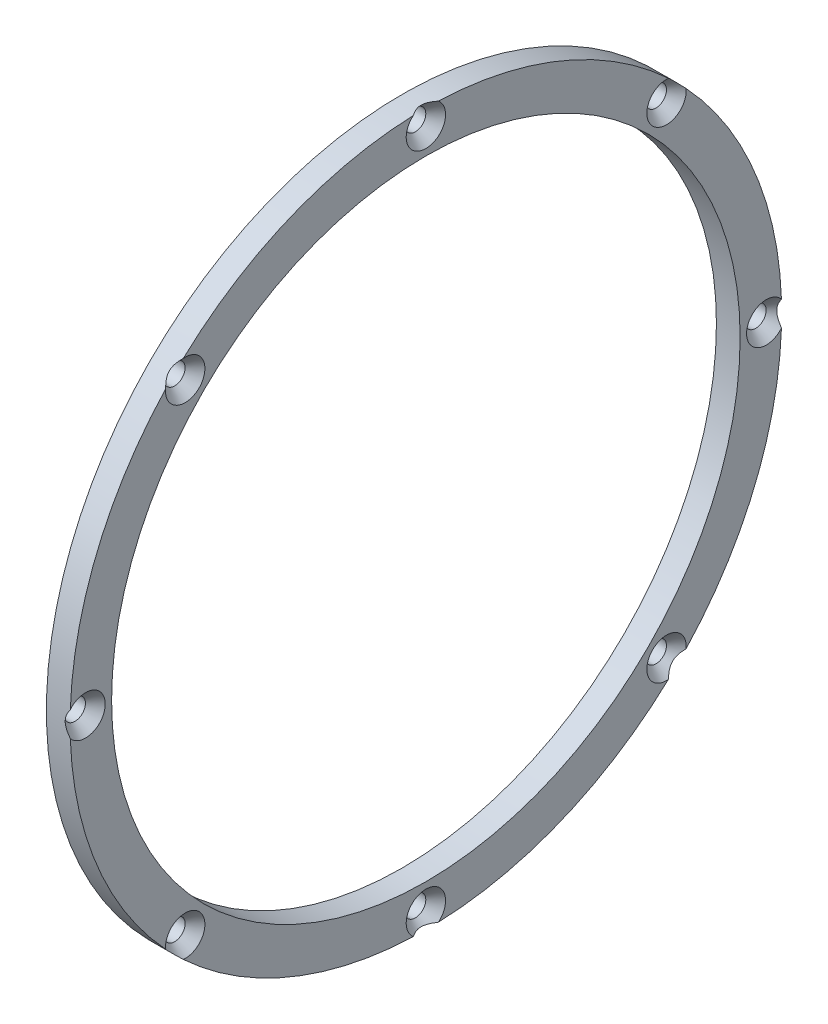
ISO-10303-21;
HEADER;
FILE_DESCRIPTION(('STEP AP214'),'2;1');
FILE_NAME('part.step','',(''),(''),'','','');
FILE_SCHEMA(('AUTOMOTIVE_DESIGN { 1 0 10303 214 1 1 1 1 }'));
ENDSEC;
DATA;
#1=APPLICATION_CONTEXT('core data for automotive mechanical design processes');
#2=APPLICATION_PROTOCOL_DEFINITION('international standard','automotive_design',2000,#1);
#3=PRODUCT_CONTEXT('',#1,'mechanical');
#4=PRODUCT('Part','Part','',(#3));
#5=PRODUCT_RELATED_PRODUCT_CATEGORY('part','',(#4));
#6=PRODUCT_DEFINITION_FORMATION('','',#4);
#7=PRODUCT_DEFINITION_CONTEXT('part definition',#1,'design');
#8=PRODUCT_DEFINITION('design','',#6,#7);
#9=PRODUCT_DEFINITION_SHAPE('','',#8);
#10=(LENGTH_UNIT() NAMED_UNIT(*) SI_UNIT(.MILLI.,.METRE.));
#11=(NAMED_UNIT(*) PLANE_ANGLE_UNIT() SI_UNIT($,.RADIAN.));
#12=(NAMED_UNIT(*) SI_UNIT($,.STERADIAN.) SOLID_ANGLE_UNIT());
#13=UNCERTAINTY_MEASURE_WITH_UNIT(LENGTH_MEASURE(1.E-05),#10,'distance_accuracy_value','');
#14=(GEOMETRIC_REPRESENTATION_CONTEXT(3) GLOBAL_UNCERTAINTY_ASSIGNED_CONTEXT((#13)) GLOBAL_UNIT_ASSIGNED_CONTEXT((#10,
#11,#12)) REPRESENTATION_CONTEXT('',''));
#15=CARTESIAN_POINT('',(0.,0.,0.));
#16=DIRECTION('',(0.,0.,1.));
#17=DIRECTION('',(1.,0.,0.));
#18=AXIS2_PLACEMENT_3D('',#15,#16,#17);
#19=CARTESIAN_POINT('',(5.08,0.,0.));
#20=DIRECTION('',(-1.,0.,0.));
#21=DIRECTION('',(0.,0.,1.));
#22=AXIS2_PLACEMENT_3D('',#19,#20,#21);
#23=CYLINDRICAL_SURFACE('',#22,76.2);
#24=CARTESIAN_POINT('',(5.08,0.,0.));
#25=DIRECTION('',(1.,0.,0.));
#26=DIRECTION('',(0.,0.,-1.));
#27=AXIS2_PLACEMENT_3D('',#24,#25,#26);
#28=CIRCLE('',#27,76.2);
#29=CARTESIAN_POINT('',(5.08,55.743451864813,-51.9529361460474));
#30=VERTEX_POINT('',#29);
#31=CARTESIAN_POINT('',(5.08,76.152846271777,-2.68029936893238));
#32=VERTEX_POINT('',#31);
#33=EDGE_CURVE('E105',#30,#32,#28,.T.);
#34=ORIENTED_EDGE('',*,*,#33,.F.);
#35=CARTESIAN_POINT('',(5.08020000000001,55.7436467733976,-51.9527270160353));
#36=CARTESIAN_POINT('',(5.0394668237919,55.7039481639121,-51.995322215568));
#37=CARTESIAN_POINT('',(4.99927459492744,55.6639433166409,-52.0381484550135));
#38=CARTESIAN_POINT('',(4.92012786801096,55.5832551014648,-52.1243248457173));
#39=CARTESIAN_POINT('',(4.88117361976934,55.5425715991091,-52.1676751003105));
#40=CARTESIAN_POINT('',(4.76615482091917,55.4191371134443,-52.2988881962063));
#41=CARTESIAN_POINT('',(4.69222534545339,55.3352827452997,-52.3876121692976));
#42=CARTESIAN_POINT('',(4.54987941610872,55.1617644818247,-52.5702963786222));
#43=CARTESIAN_POINT('',(4.4816785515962,55.0720032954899,-52.6643337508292));
#44=CARTESIAN_POINT('',(4.35597616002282,54.8885479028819,-52.8555088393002));
#45=CARTESIAN_POINT('',(4.29845910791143,54.7948596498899,-52.952641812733));
#46=CARTESIAN_POINT('',(4.21597667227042,54.6384130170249,-53.1139475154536));
#47=CARTESIAN_POINT('',(4.18680376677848,54.5768908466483,-53.1771656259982));
#48=CARTESIAN_POINT('',(4.13507516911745,54.4522610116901,-53.3047767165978));
#49=CARTESIAN_POINT('',(4.11251960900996,54.3891533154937,-53.3691697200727));
#50=CARTESIAN_POINT('',(4.07517669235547,54.2623381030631,-53.4981003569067));
#51=CARTESIAN_POINT('',(4.0603023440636,54.1986460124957,-53.5626276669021));
#52=CARTESIAN_POINT('',(4.0386390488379,54.0703486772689,-53.692138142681));
#53=CARTESIAN_POINT('',(4.03184933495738,54.0057435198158,-53.7571212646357));
#54=CARTESIAN_POINT('',(4.02669903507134,53.8758261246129,-53.8873255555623));
#55=CARTESIAN_POINT('',(4.02837785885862,53.8105119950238,-53.9525464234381));
#56=CARTESIAN_POINT('',(4.04016428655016,53.6800316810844,-54.0823693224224));
#57=CARTESIAN_POINT('',(4.0502725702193,53.6148655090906,-54.146971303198));
#58=CARTESIAN_POINT('',(4.07856755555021,53.4844042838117,-54.2758418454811));
#59=CARTESIAN_POINT('',(4.09684965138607,53.419117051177,-54.340097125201));
#60=CARTESIAN_POINT('',(4.14066332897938,53.2895899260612,-54.4671262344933));
#61=CARTESIAN_POINT('',(4.16619454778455,53.2253499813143,-54.5299001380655));
#62=CARTESIAN_POINT('',(4.24410287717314,53.052470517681,-54.6982506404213));
#63=CARTESIAN_POINT('',(4.30260072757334,52.945033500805,-54.802233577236));
#64=CARTESIAN_POINT('',(4.43343543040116,52.7338844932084,-55.0054450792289));
#65=CARTESIAN_POINT('',(4.50580317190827,52.6301814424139,-55.104662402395));
#66=CARTESIAN_POINT('',(4.65839397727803,52.4291006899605,-55.2960045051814));
#67=CARTESIAN_POINT('',(4.73834318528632,52.3316273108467,-55.3882497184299));
#68=CARTESIAN_POINT('',(4.86327354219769,52.1877626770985,-55.5237042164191));
#69=CARTESIAN_POINT('',(4.90563359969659,52.1403203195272,-55.5682568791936));
#70=CARTESIAN_POINT('',(4.99184796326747,52.0460694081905,-55.6565433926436));
#71=CARTESIAN_POINT('',(5.03570185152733,51.9992606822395,-55.7002774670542));
#72=CARTESIAN_POINT('',(5.08020000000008,51.9527270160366,-55.7436467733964));
#73=B_SPLINE_CURVE_WITH_KNOTS('',3,(#35,#36,#37,#38,#39,#40,#41,#42,#43,#44,#45,#46,#47,#48,#49,
#50,#51,#52,#53,#54,#55,#56,#57,#58,#59,#60,#61,#62,#63,#64,#65,#66,#67,#68,#69,#70,#71,#72),
.UNSPECIFIED.,.F.,.F.,(4,2,2,2,2,2,2,2,2,2,2,2,2,2,2,2,2,2,4),(0.,0.21317377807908,
0.426390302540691,0.854334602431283,1.29440567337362,1.73383217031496,2.01235344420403,
2.29088027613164,2.56617943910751,2.84145248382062,3.11800773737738,3.3945852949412,
3.6744785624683,3.95435781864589,4.43498055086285,4.91668636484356,5.38501904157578,
5.61796433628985,5.85084500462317),.UNSPECIFIED.);
#74=CARTESIAN_POINT('',(5.08,51.9529361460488,-55.7434518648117));
#75=VERTEX_POINT('',#74);
#76=EDGE_CURVE('E11',#30,#75,#73,.T.);
#77=ORIENTED_EDGE('',*,*,#76,.T.);
#78=CARTESIAN_POINT('',(5.08,2.68029936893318,-76.152846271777));
#79=VERTEX_POINT('',#78);
#80=EDGE_CURVE('E107',#79,#75,#28,.T.);
#81=ORIENTED_EDGE('',*,*,#80,.F.);
#82=CARTESIAN_POINT('',(5.08020000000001,2.68058506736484,-76.1528362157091));
#83=CARTESIAN_POINT('',(5.03946682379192,2.62239455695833,-76.1548844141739));
#84=CARTESIAN_POINT('',(4.99927459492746,2.56382413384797,-76.1568794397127));
#85=CARTESIAN_POINT('',(4.92012786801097,2.44583303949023,-76.1607601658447));
#86=CARTESIAN_POINT('',(4.88117361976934,2.38641220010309,-76.1626458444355));
#87=CARTESIAN_POINT('',(4.76615482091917,2.20634916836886,-76.1681461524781));
#88=CARTESIAN_POINT('',(4.69222534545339,2.08431785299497,-76.1715894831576));
#89=CARTESIAN_POINT('',(4.54987941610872,1.83244466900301,-76.1780707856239));
#90=CARTESIAN_POINT('',(4.48167855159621,1.70247946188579,-76.1810945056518));
#91=CARTESIAN_POINT('',(4.35597616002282,1.4375757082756,-76.1865531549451));
#92=CARTESIAN_POINT('',(4.29845910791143,1.30264472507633,-76.1889889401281));
#93=CARTESIAN_POINT('',(4.21597667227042,1.07795989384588,-76.1924248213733));
#94=CARTESIAN_POINT('',(4.18680376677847,0.989755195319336,-76.1936240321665));
#95=CARTESIAN_POINT('',(4.13507516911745,0.811393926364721,-76.195732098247));
#96=CARTESIAN_POINT('',(4.11251960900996,0.721237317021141,-76.1966409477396));
#97=CARTESIAN_POINT('',(4.07517669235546,0.540397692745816,-76.1981367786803));
#98=CARTESIAN_POINT('',(4.06030234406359,0.449732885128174,-76.1987273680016));
#99=CARTESIAN_POINT('',(4.03863904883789,0.267435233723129,-76.1995851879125));
#100=CARTESIAN_POINT('',(4.03184933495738,0.175802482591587,-76.1998524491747));
#101=CARTESIAN_POINT('',(4.02669903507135,-0.00813132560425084,-76.2000553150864));
#102=CARTESIAN_POINT('',(4.02837785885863,-0.100433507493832,-76.1999893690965));
#103=CARTESIAN_POINT('',(4.04016428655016,-0.284495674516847,-76.1995245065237));
#104=CARTESIAN_POINT('',(4.05027257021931,-0.376255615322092,-76.1991255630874));
#105=CARTESIAN_POINT('',(4.07856755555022,-0.55963086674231,-76.1980007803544));
#106=CARTESIAN_POINT('',(4.09684965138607,-0.651231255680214,-76.1972710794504));
#107=CARTESIAN_POINT('',(4.14066332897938,-0.832643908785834,-76.1955047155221));
#108=CARTESIAN_POINT('',(4.16619454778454,-0.922456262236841,-76.194468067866));
#109=CARTESIAN_POINT('',(4.24410287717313,-1.16374228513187,-76.1912656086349));
#110=CARTESIAN_POINT('',(4.30260072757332,-1.3132387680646,-76.1888232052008));
#111=CARTESIAN_POINT('',(4.43343543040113,-1.60623589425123,-76.1832105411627));
#112=CARTESIAN_POINT('',(4.50580317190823,-1.74972226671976,-76.1800386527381));
#113=CARTESIAN_POINT('',(4.65839397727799,-2.02720712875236,-76.173152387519));
#114=CARTESIAN_POINT('',(4.73834318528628,-2.16135843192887,-76.1694555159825));
#115=CARTESIAN_POINT('',(4.86327354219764,-2.35886688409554,-76.1635086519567));
#116=CARTESIAN_POINT('',(4.90563359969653,-2.42391718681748,-76.1614653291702));
#117=CARTESIAN_POINT('',(4.9918479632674,-2.55299063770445,-76.1572478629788));
#118=CARTESIAN_POINT('',(5.03570185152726,-2.61701406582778,-76.1550737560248));
#119=CARTESIAN_POINT('',(5.08020000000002,-2.68058506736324,-76.1528362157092));
#120=B_SPLINE_CURVE_WITH_KNOTS('',3,(#82,#83,#84,#85,#86,#87,#88,#89,#90,#91,#92,#93,#94,#95,
#96,#97,#98,#99,#100,#101,#102,#103,#104,#105,#106,#107,#108,#109,#110,#111,#112,#113,#114,#115,
#116,#117,#118,#119),.UNSPECIFIED.,.F.,.F.,(4,2,2,2,2,2,2,2,2,2,2,2,2,2,2,2,2,2,4),(0.,
0.213173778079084,0.426390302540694,0.854334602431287,1.29440567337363,1.73383217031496,
2.01235344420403,2.29088027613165,2.56617943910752,2.84145248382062,3.1180077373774,
3.39458529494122,3.67447856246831,3.9543578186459,4.43498055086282,4.91668636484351,
5.38501904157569,5.61796433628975,5.85084500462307),.UNSPECIFIED.);
#121=CARTESIAN_POINT('',(5.08,-2.68029936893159,-76.152846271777));
#122=VERTEX_POINT('',#121);
#123=EDGE_CURVE('E43',#79,#122,#120,.T.);
#124=ORIENTED_EDGE('',*,*,#123,.T.);
#125=CARTESIAN_POINT('',(5.08,-51.9529361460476,-55.7434518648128));
#126=VERTEX_POINT('',#125);
#127=EDGE_CURVE('E117',#126,#122,#28,.T.);
#128=ORIENTED_EDGE('',*,*,#127,.F.);
#129=CARTESIAN_POINT('',(5.08020000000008,-51.9527270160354,-55.7436467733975));
#130=CARTESIAN_POINT('',(5.03946682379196,-51.9953222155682,-55.703948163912));
#131=CARTESIAN_POINT('',(4.99927459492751,-52.0381484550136,-55.6639433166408));
#132=CARTESIAN_POINT('',(4.92012786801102,-52.1243248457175,-55.5832551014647));
#133=CARTESIAN_POINT('',(4.8811736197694,-52.1676751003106,-55.5425715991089));
#134=CARTESIAN_POINT('',(4.76615482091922,-52.2988881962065,-55.4191371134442));
#135=CARTESIAN_POINT('',(4.69222534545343,-52.3876121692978,-55.3352827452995));
#136=CARTESIAN_POINT('',(4.54987941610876,-52.5702963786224,-55.1617644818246));
#137=CARTESIAN_POINT('',(4.48167855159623,-52.6643337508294,-55.0720032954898));
#138=CARTESIAN_POINT('',(4.35597616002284,-52.8555088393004,-54.8885479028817));
#139=CARTESIAN_POINT('',(4.29845910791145,-52.9526418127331,-54.7948596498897));
#140=CARTESIAN_POINT('',(4.21597667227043,-53.1139475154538,-54.6384130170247));
#141=CARTESIAN_POINT('',(4.18680376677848,-53.1771656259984,-54.5768908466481));
#142=CARTESIAN_POINT('',(4.13507516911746,-53.3047767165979,-54.4522610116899));
#143=CARTESIAN_POINT('',(4.11251960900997,-53.3691697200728,-54.3891533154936));
#144=CARTESIAN_POINT('',(4.07517669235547,-53.4981003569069,-54.262338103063));
#145=CARTESIAN_POINT('',(4.0603023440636,-53.5626276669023,-54.1986460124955));
#146=CARTESIAN_POINT('',(4.0386390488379,-53.6921381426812,-54.0703486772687));
#147=CARTESIAN_POINT('',(4.03184933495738,-53.7571212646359,-54.0057435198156));
#148=CARTESIAN_POINT('',(4.02669903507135,-53.8873255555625,-53.8758261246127));
#149=CARTESIAN_POINT('',(4.02837785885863,-53.9525464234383,-53.8105119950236));
#150=CARTESIAN_POINT('',(4.04016428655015,-54.0823693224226,-53.6800316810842));
#151=CARTESIAN_POINT('',(4.05027257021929,-54.1469713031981,-53.6148655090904));
#152=CARTESIAN_POINT('',(4.0785675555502,-54.2758418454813,-53.4844042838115));
#153=CARTESIAN_POINT('',(4.09684965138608,-54.3400971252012,-53.4191170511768));
#154=CARTESIAN_POINT('',(4.14066332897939,-54.4671262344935,-53.289589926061));
#155=CARTESIAN_POINT('',(4.16619454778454,-54.5299001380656,-53.2253499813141));
#156=CARTESIAN_POINT('',(4.24410287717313,-54.6982506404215,-53.0524705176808));
#157=CARTESIAN_POINT('',(4.30260072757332,-54.8022335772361,-52.9450335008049));
#158=CARTESIAN_POINT('',(4.43343543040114,-55.005445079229,-52.7338844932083));
#159=CARTESIAN_POINT('',(4.50580317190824,-55.1046624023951,-52.6301814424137));
#160=CARTESIAN_POINT('',(4.65839397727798,-55.2960045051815,-52.4291006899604));
#161=CARTESIAN_POINT('',(4.73834318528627,-55.38824971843,-52.3316273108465));
#162=CARTESIAN_POINT('',(4.86327354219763,-55.5237042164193,-52.1877626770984));
#163=CARTESIAN_POINT('',(4.90563359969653,-55.5682568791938,-52.1403203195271));
#164=CARTESIAN_POINT('',(4.9918479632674,-55.6565433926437,-52.0460694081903));
#165=CARTESIAN_POINT('',(5.03570185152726,-55.7002774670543,-51.9992606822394));
#166=CARTESIAN_POINT('',(5.08020000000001,-55.7436467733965,-51.9527270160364));
#167=B_SPLINE_CURVE_WITH_KNOTS('',3,(#129,#130,#131,#132,#133,#134,#135,#136,#137,#138,#139,
#140,#141,#142,#143,#144,#145,#146,#147,#148,#149,#150,#151,#152,#153,#154,#155,#156,#157,#158,
#159,#160,#161,#162,#163,#164,#165,#166),.UNSPECIFIED.,.F.,.F.,(4,2,2,2,2,2,2,2,2,2,2,2,2,2,2,2,
2,2,4),(0.,0.213173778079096,0.426390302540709,0.854334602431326,1.29440567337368,
1.73383217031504,2.01235344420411,2.29088027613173,2.56617943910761,2.84145248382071,
3.11800773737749,3.3945852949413,3.6744785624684,3.95435781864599,4.43498055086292,
4.9166863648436,5.38501904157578,5.61796433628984,5.85084500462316),.UNSPECIFIED.);
#168=CARTESIAN_POINT('',(5.08,-55.7434518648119,-51.9529361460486));
#169=VERTEX_POINT('',#168);
#170=EDGE_CURVE('E146',#126,#169,#167,.T.);
#171=ORIENTED_EDGE('',*,*,#170,.T.);
#172=CARTESIAN_POINT('',(5.08,-76.1528462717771,-2.68029936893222));
#173=VERTEX_POINT('',#172);
#174=EDGE_CURVE('E136',#173,#169,#28,.T.);
#175=ORIENTED_EDGE('',*,*,#174,.F.);
#176=CARTESIAN_POINT('',(5.08020000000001,-76.1528362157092,-2.68058506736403));
#177=CARTESIAN_POINT('',(5.0394668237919,-76.1548844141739,-2.62239455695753));
#178=CARTESIAN_POINT('',(4.99927459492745,-76.1568794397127,-2.56382413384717));
#179=CARTESIAN_POINT('',(4.92012786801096,-76.1607601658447,-2.44583303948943));
#180=CARTESIAN_POINT('',(4.88117361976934,-76.1626458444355,-2.38641220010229));
#181=CARTESIAN_POINT('',(4.76615482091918,-76.1681461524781,-2.20634916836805));
#182=CARTESIAN_POINT('',(4.69222534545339,-76.1715894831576,-2.08431785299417));
#183=CARTESIAN_POINT('',(4.54987941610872,-76.1780707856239,-1.83244466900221));
#184=CARTESIAN_POINT('',(4.4816785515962,-76.1810945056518,-1.70247946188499));
#185=CARTESIAN_POINT('',(4.35597616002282,-76.1865531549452,-1.4375757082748));
#186=CARTESIAN_POINT('',(4.29845910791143,-76.1889889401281,-1.30264472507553));
#187=CARTESIAN_POINT('',(4.21597667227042,-76.1924248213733,-1.07795989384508));
#188=CARTESIAN_POINT('',(4.18680376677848,-76.1936240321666,-0.989755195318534));
#189=CARTESIAN_POINT('',(4.13507516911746,-76.195732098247,-0.811393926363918));
#190=CARTESIAN_POINT('',(4.11251960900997,-76.1966409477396,-0.721237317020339));
#191=CARTESIAN_POINT('',(4.07517669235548,-76.1981367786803,-0.540397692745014));
#192=CARTESIAN_POINT('',(4.06030234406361,-76.1987273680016,-0.449732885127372));
#193=CARTESIAN_POINT('',(4.0386390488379,-76.1995851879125,-0.267435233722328));
#194=CARTESIAN_POINT('',(4.03184933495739,-76.1998524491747,-0.175802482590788));
#195=CARTESIAN_POINT('',(4.02669903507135,-76.2000553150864,0.00813132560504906));
#196=CARTESIAN_POINT('',(4.02837785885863,-76.1999893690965,0.100433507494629));
#197=CARTESIAN_POINT('',(4.04016428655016,-76.1995245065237,0.284495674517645));
#198=CARTESIAN_POINT('',(4.0502725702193,-76.1991255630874,0.376255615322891));
#199=CARTESIAN_POINT('',(4.07856755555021,-76.1980007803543,0.559630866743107));
#200=CARTESIAN_POINT('',(4.09684965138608,-76.1972710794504,0.651231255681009));
#201=CARTESIAN_POINT('',(4.1406633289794,-76.1955047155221,0.832643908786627));
#202=CARTESIAN_POINT('',(4.16619454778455,-76.194468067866,0.922456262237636));
#203=CARTESIAN_POINT('',(4.24410287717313,-76.1912656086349,1.16374228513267));
#204=CARTESIAN_POINT('',(4.30260072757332,-76.1888232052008,1.3132387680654));
#205=CARTESIAN_POINT('',(4.43343543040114,-76.1832105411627,1.60623589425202));
#206=CARTESIAN_POINT('',(4.50580317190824,-76.1800386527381,1.74972226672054));
#207=CARTESIAN_POINT('',(4.65839397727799,-76.173152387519,2.02720712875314));
#208=CARTESIAN_POINT('',(4.73834318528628,-76.1694555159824,2.16135843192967));
#209=CARTESIAN_POINT('',(4.86327354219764,-76.1635086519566,2.35886688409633));
#210=CARTESIAN_POINT('',(4.90563359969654,-76.1614653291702,2.42391718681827));
#211=CARTESIAN_POINT('',(4.99184796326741,-76.1572478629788,2.55299063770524));
#212=CARTESIAN_POINT('',(5.03570185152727,-76.1550737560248,2.61701406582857));
#213=CARTESIAN_POINT('',(5.08020000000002,-76.1528362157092,2.68058506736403));
#214=B_SPLINE_CURVE_WITH_KNOTS('',3,(#176,#177,#178,#179,#180,#181,#182,#183,#184,#185,#186,
#187,#188,#189,#190,#191,#192,#193,#194,#195,#196,#197,#198,#199,#200,#201,#202,#203,#204,#205,
#206,#207,#208,#209,#210,#211,#212,#213),.UNSPECIFIED.,.F.,.F.,(4,2,2,2,2,2,2,2,2,2,2,2,2,2,2,2,
2,2,4),(0.,0.213173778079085,0.426390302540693,0.854334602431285,1.29440567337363,
1.73383217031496,2.01235344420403,2.29088027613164,2.56617943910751,2.84145248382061,
3.11800773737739,3.3945852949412,3.6744785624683,3.95435781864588,4.43498055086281,
4.91668636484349,5.38501904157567,5.61796433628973,5.85084500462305),.UNSPECIFIED.);
#215=CARTESIAN_POINT('',(5.08,-76.152846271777,2.68029936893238));
#216=VERTEX_POINT('',#215);
#217=EDGE_CURVE('E148',#173,#216,#214,.T.);
#218=ORIENTED_EDGE('',*,*,#217,.T.);
#219=CARTESIAN_POINT('',(5.08,-55.7434518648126,51.952936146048));
#220=VERTEX_POINT('',#219);
#221=EDGE_CURVE('E132',#220,#216,#28,.T.);
#222=ORIENTED_EDGE('',*,*,#221,.F.);
#223=CARTESIAN_POINT('',(5.08020000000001,-55.7436467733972,51.9527270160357));
#224=CARTESIAN_POINT('',(5.0394668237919,-55.7039481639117,51.9953222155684));
#225=CARTESIAN_POINT('',(4.99927459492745,-55.6639433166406,52.0381484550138));
#226=CARTESIAN_POINT('',(4.92012786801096,-55.5832551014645,52.1243248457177));
#227=CARTESIAN_POINT('',(4.88117361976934,-55.5425715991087,52.1676751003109));
#228=CARTESIAN_POINT('',(4.76615482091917,-55.419137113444,52.2988881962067));
#229=CARTESIAN_POINT('',(4.69222534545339,-55.3352827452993,52.387612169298));
#230=CARTESIAN_POINT('',(4.54987941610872,-55.1617644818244,52.5702963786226));
#231=CARTESIAN_POINT('',(4.48167855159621,-55.0720032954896,52.6643337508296));
#232=CARTESIAN_POINT('',(4.35597616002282,-54.8885479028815,52.8555088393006));
#233=CARTESIAN_POINT('',(4.29845910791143,-54.7948596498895,52.9526418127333));
#234=CARTESIAN_POINT('',(4.21597667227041,-54.6384130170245,53.113947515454));
#235=CARTESIAN_POINT('',(4.18680376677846,-54.5768908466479,53.1771656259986));
#236=CARTESIAN_POINT('',(4.13507516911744,-54.4522610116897,53.3047767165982));
#237=CARTESIAN_POINT('',(4.11251960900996,-54.3891533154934,53.369169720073));
#238=CARTESIAN_POINT('',(4.07517669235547,-54.2623381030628,53.4981003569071));
#239=CARTESIAN_POINT('',(4.0603023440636,-54.1986460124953,53.5626276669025));
#240=CARTESIAN_POINT('',(4.03863904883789,-54.0703486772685,53.6921381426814));
#241=CARTESIAN_POINT('',(4.03184933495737,-54.0057435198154,53.7571212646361));
#242=CARTESIAN_POINT('',(4.02669903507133,-53.8758261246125,53.8873255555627));
#243=CARTESIAN_POINT('',(4.02837785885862,-53.8105119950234,53.9525464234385));
#244=CARTESIAN_POINT('',(4.04016428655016,-53.680031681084,54.0823693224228));
#245=CARTESIAN_POINT('',(4.0502725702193,-53.6148655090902,54.1469713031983));
#246=CARTESIAN_POINT('',(4.07856755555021,-53.4844042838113,54.2758418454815));
#247=CARTESIAN_POINT('',(4.09684965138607,-53.4191170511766,54.3400971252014));
#248=CARTESIAN_POINT('',(4.14066332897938,-53.2895899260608,54.4671262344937));
#249=CARTESIAN_POINT('',(4.16619454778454,-53.225349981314,54.5299001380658));
#250=CARTESIAN_POINT('',(4.24410287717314,-53.0524705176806,54.6982506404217));
#251=CARTESIAN_POINT('',(4.30260072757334,-52.9450335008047,54.8022335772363));
#252=CARTESIAN_POINT('',(4.43343543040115,-52.733884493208,55.0054450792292));
#253=CARTESIAN_POINT('',(4.50580317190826,-52.6301814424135,55.1046624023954));
#254=CARTESIAN_POINT('',(4.65839397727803,-52.4291006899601,55.2960045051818));
#255=CARTESIAN_POINT('',(4.73834318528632,-52.3316273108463,55.3882497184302));
#256=CARTESIAN_POINT('',(4.86327354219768,-52.1877626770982,55.5237042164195));
#257=CARTESIAN_POINT('',(4.90563359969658,-52.1403203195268,55.568256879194));
#258=CARTESIAN_POINT('',(4.99184796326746,-52.0460694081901,55.6565433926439));
#259=CARTESIAN_POINT('',(5.03570185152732,-51.9992606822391,55.7002774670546));
#260=CARTESIAN_POINT('',(5.08020000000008,-51.9527270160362,55.7436467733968));
#261=B_SPLINE_CURVE_WITH_KNOTS('',3,(#223,#224,#225,#226,#227,#228,#229,#230,#231,#232,#233,
#234,#235,#236,#237,#238,#239,#240,#241,#242,#243,#244,#245,#246,#247,#248,#249,#250,#251,#252,
#253,#254,#255,#256,#257,#258,#259,#260),.UNSPECIFIED.,.F.,.F.,(4,2,2,2,2,2,2,2,2,2,2,2,2,2,2,2,
2,2,4),(0.,0.213173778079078,0.426390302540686,0.854334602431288,1.29440567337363,
1.73383217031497,2.01235344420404,2.29088027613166,2.56617943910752,2.84145248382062,
3.1180077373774,3.39458529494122,3.6744785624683,3.9543578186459,4.43498055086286,
4.91668636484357,5.38501904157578,5.61796433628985,5.85084500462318),.UNSPECIFIED.);
#262=CARTESIAN_POINT('',(5.08,-51.9529361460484,55.7434518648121));
#263=VERTEX_POINT('',#262);
#264=EDGE_CURVE('E194',#220,#263,#261,.T.);
#265=ORIENTED_EDGE('',*,*,#264,.T.);
#266=CARTESIAN_POINT('',(5.08,-2.68029936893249,76.1528462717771));
#267=VERTEX_POINT('',#266);
#268=EDGE_CURVE('E128',#267,#263,#28,.T.);
#269=ORIENTED_EDGE('',*,*,#268,.F.);
#270=CARTESIAN_POINT('',(5.08020000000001,-2.6805850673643,76.1528362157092));
#271=CARTESIAN_POINT('',(5.03946682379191,-2.6223945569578,76.1548844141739));
#272=CARTESIAN_POINT('',(4.99927459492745,-2.56382413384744,76.1568794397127));
#273=CARTESIAN_POINT('',(4.92012786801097,-2.44583303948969,76.1607601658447));
#274=CARTESIAN_POINT('',(4.88117361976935,-2.38641220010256,76.1626458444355));
#275=CARTESIAN_POINT('',(4.76615482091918,-2.20634916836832,76.1681461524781));
#276=CARTESIAN_POINT('',(4.69222534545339,-2.08431785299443,76.1715894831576));
#277=CARTESIAN_POINT('',(4.54987941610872,-1.83244466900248,76.1780707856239));
#278=CARTESIAN_POINT('',(4.48167855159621,-1.70247946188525,76.1810945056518));
#279=CARTESIAN_POINT('',(4.35597616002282,-1.43757570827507,76.1865531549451));
#280=CARTESIAN_POINT('',(4.29845910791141,-1.3026447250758,76.1889889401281));
#281=CARTESIAN_POINT('',(4.21597667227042,-1.07795989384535,76.1924248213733));
#282=CARTESIAN_POINT('',(4.18680376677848,-0.989755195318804,76.1936240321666));
#283=CARTESIAN_POINT('',(4.13507516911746,-0.811393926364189,76.195732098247));
#284=CARTESIAN_POINT('',(4.11251960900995,-0.721237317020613,76.1966409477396));
#285=CARTESIAN_POINT('',(4.07517669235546,-0.540397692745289,76.1981367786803));
#286=CARTESIAN_POINT('',(4.0603023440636,-0.449732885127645,76.1987273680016));
#287=CARTESIAN_POINT('',(4.03863904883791,-0.267435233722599,76.1995851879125));
#288=CARTESIAN_POINT('',(4.03184933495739,-0.175802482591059,76.1998524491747));
#289=CARTESIAN_POINT('',(4.02669903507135,0.00813132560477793,76.2000553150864));
#290=CARTESIAN_POINT('',(4.02837785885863,0.100433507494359,76.1999893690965));
#291=CARTESIAN_POINT('',(4.04016428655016,0.284495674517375,76.1995245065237));
#292=CARTESIAN_POINT('',(4.05027257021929,0.376255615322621,76.1991255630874));
#293=CARTESIAN_POINT('',(4.0785675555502,0.559630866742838,76.1980007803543));
#294=CARTESIAN_POINT('',(4.09684965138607,0.65123125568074,76.1972710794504));
#295=CARTESIAN_POINT('',(4.14066332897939,0.832643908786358,76.1955047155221));
#296=CARTESIAN_POINT('',(4.16619454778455,0.922456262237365,76.194468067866));
#297=CARTESIAN_POINT('',(4.24410287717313,1.1637422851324,76.1912656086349));
#298=CARTESIAN_POINT('',(4.30260072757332,1.31323876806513,76.1888232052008));
#299=CARTESIAN_POINT('',(4.43343543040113,1.60623589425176,76.1832105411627));
#300=CARTESIAN_POINT('',(4.50580317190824,1.74972226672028,76.1800386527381));
#301=CARTESIAN_POINT('',(4.65839397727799,2.02720712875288,76.173152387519));
#302=CARTESIAN_POINT('',(4.73834318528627,2.16135843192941,76.1694555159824));
#303=CARTESIAN_POINT('',(4.86327354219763,2.35886688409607,76.1635086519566));
#304=CARTESIAN_POINT('',(4.90563359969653,2.42391718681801,76.1614653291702));
#305=CARTESIAN_POINT('',(4.99184796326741,2.55299063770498,76.1572478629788));
#306=CARTESIAN_POINT('',(5.03570185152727,2.61701406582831,76.1550737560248));
#307=CARTESIAN_POINT('',(5.08020000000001,2.68058506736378,76.1528362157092));
#308=B_SPLINE_CURVE_WITH_KNOTS('',3,(#270,#271,#272,#273,#274,#275,#276,#277,#278,#279,#280,
#281,#282,#283,#284,#285,#286,#287,#288,#289,#290,#291,#292,#293,#294,#295,#296,#297,#298,#299,
#300,#301,#302,#303,#304,#305,#306,#307),.UNSPECIFIED.,.F.,.F.,(4,2,2,2,2,2,2,2,2,2,2,2,2,2,2,2,
2,2,4),(0.,0.213173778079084,0.426390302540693,0.854334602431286,1.29440567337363,
1.73383217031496,2.01235344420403,2.29088027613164,2.56617943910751,2.84145248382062,
3.11800773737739,3.39458529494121,3.6744785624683,3.95435781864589,4.43498055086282,
4.9166863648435,5.38501904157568,5.61796433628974,5.85084500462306),.UNSPECIFIED.);
#309=CARTESIAN_POINT('',(5.08,2.68029936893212,76.152846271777));
#310=VERTEX_POINT('',#309);
#311=EDGE_CURVE('E219',#267,#310,#308,.T.);
#312=ORIENTED_EDGE('',*,*,#311,.T.);
#313=CARTESIAN_POINT('',(5.08,51.9529361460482,55.7434518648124));
#314=VERTEX_POINT('',#313);
#315=EDGE_CURVE('E123',#314,#310,#28,.T.);
#316=ORIENTED_EDGE('',*,*,#315,.F.);
#317=CARTESIAN_POINT('',(5.08020000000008,51.9527270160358,55.7436467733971));
#318=CARTESIAN_POINT('',(5.03946682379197,51.9953222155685,55.7039481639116));
#319=CARTESIAN_POINT('',(4.99927459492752,52.038148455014,55.6639433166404));
#320=CARTESIAN_POINT('',(4.92012786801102,52.1243248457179,55.5832551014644));
#321=CARTESIAN_POINT('',(4.8811736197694,52.167675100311,55.5425715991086));
#322=CARTESIAN_POINT('',(4.76615482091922,52.2988881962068,55.4191371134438));
#323=CARTESIAN_POINT('',(4.69222534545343,52.3876121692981,55.3352827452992));
#324=CARTESIAN_POINT('',(4.54987941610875,52.5702963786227,55.1617644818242));
#325=CARTESIAN_POINT('',(4.48167855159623,52.6643337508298,55.0720032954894));
#326=CARTESIAN_POINT('',(4.35597616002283,52.8555088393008,54.8885479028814));
#327=CARTESIAN_POINT('',(4.29845910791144,52.9526418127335,54.7948596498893));
#328=CARTESIAN_POINT('',(4.21597667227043,53.1139475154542,54.6384130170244));
#329=CARTESIAN_POINT('',(4.18680376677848,53.1771656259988,54.5768908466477));
#330=CARTESIAN_POINT('',(4.13507516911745,53.3047767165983,54.4522610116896));
#331=CARTESIAN_POINT('',(4.11251960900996,53.3691697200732,54.3891533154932));
#332=CARTESIAN_POINT('',(4.07517669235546,53.4981003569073,54.2623381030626));
#333=CARTESIAN_POINT('',(4.06030234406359,53.5626276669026,54.1986460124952));
#334=CARTESIAN_POINT('',(4.03863904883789,53.6921381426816,54.0703486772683));
#335=CARTESIAN_POINT('',(4.03184933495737,53.7571212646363,54.0057435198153));
#336=CARTESIAN_POINT('',(4.02669903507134,53.8873255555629,53.8758261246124));
#337=CARTESIAN_POINT('',(4.02837785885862,53.9525464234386,53.8105119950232));
#338=CARTESIAN_POINT('',(4.04016428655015,54.082369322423,53.6800316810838));
#339=CARTESIAN_POINT('',(4.05027257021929,54.1469713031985,53.61486550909));
#340=CARTESIAN_POINT('',(4.07856755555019,54.2758418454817,53.4844042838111));
#341=CARTESIAN_POINT('',(4.09684965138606,54.3400971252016,53.4191170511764));
#342=CARTESIAN_POINT('',(4.14066332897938,54.4671262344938,53.2895899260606));
#343=CARTESIAN_POINT('',(4.16619454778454,54.529900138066,53.2253499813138));
#344=CARTESIAN_POINT('',(4.24410287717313,54.6982506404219,53.0524705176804));
#345=CARTESIAN_POINT('',(4.30260072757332,54.8022335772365,52.9450335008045));
#346=CARTESIAN_POINT('',(4.43343543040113,55.0054450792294,52.7338844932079));
#347=CARTESIAN_POINT('',(4.50580317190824,55.1046624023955,52.6301814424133));
#348=CARTESIAN_POINT('',(4.65839397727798,55.2960045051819,52.42910068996));
#349=CARTESIAN_POINT('',(4.73834318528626,55.3882497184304,52.3316273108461));
#350=CARTESIAN_POINT('',(4.86327354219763,55.5237042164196,52.187762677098));
#351=CARTESIAN_POINT('',(4.90563359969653,55.5682568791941,52.1403203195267));
#352=CARTESIAN_POINT('',(4.99184796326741,55.6565433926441,52.04606940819));
#353=CARTESIAN_POINT('',(5.03570185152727,55.7002774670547,51.999260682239));
#354=CARTESIAN_POINT('',(5.08020000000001,55.7436467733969,51.952727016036));
#355=B_SPLINE_CURVE_WITH_KNOTS('',3,(#317,#318,#319,#320,#321,#322,#323,#324,#325,#326,#327,
#328,#329,#330,#331,#332,#333,#334,#335,#336,#337,#338,#339,#340,#341,#342,#343,#344,#345,#346,
#347,#348,#349,#350,#351,#352,#353,#354),.UNSPECIFIED.,.F.,.F.,(4,2,2,2,2,2,2,2,2,2,2,2,2,2,2,2,
2,2,4),(0.,0.213173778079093,0.426390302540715,0.854334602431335,1.29440567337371,
1.73383217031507,2.01235344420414,2.29088027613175,2.56617943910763,2.84145248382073,
3.11800773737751,3.39458529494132,3.67447856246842,3.95435781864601,4.43498055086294,
4.91668636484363,5.38501904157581,5.61796433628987,5.85084500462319),.UNSPECIFIED.);
#356=CARTESIAN_POINT('',(5.08,55.7434518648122,51.9529361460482));
#357=VERTEX_POINT('',#356);
#358=EDGE_CURVE('E125',#314,#357,#355,.T.);
#359=ORIENTED_EDGE('',*,*,#358,.T.);
#360=CARTESIAN_POINT('',(5.08,76.1528462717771,2.68029936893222));
#361=VERTEX_POINT('',#360);
#362=EDGE_CURVE('E116',#361,#357,#28,.T.);
#363=ORIENTED_EDGE('',*,*,#362,.F.);
#364=CARTESIAN_POINT('',(5.08020000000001,76.1528362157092,2.68058506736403));
#365=CARTESIAN_POINT('',(5.0394668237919,76.1548844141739,2.62239455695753));
#366=CARTESIAN_POINT('',(4.99927459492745,76.1568794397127,2.56382413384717));
#367=CARTESIAN_POINT('',(4.92012786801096,76.1607601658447,2.44583303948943));
#368=CARTESIAN_POINT('',(4.88117361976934,76.1626458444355,2.38641220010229));
#369=CARTESIAN_POINT('',(4.76615482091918,76.1681461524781,2.20634916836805));
#370=CARTESIAN_POINT('',(4.69222534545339,76.1715894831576,2.08431785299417));
#371=CARTESIAN_POINT('',(4.54987941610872,76.1780707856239,1.83244466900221));
#372=CARTESIAN_POINT('',(4.4816785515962,76.1810945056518,1.70247946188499));
#373=CARTESIAN_POINT('',(4.35597616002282,76.1865531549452,1.4375757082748));
#374=CARTESIAN_POINT('',(4.29845910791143,76.1889889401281,1.30264472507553));
#375=CARTESIAN_POINT('',(4.21597667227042,76.1924248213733,1.07795989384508));
#376=CARTESIAN_POINT('',(4.18680376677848,76.1936240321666,0.989755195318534));
#377=CARTESIAN_POINT('',(4.13507516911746,76.195732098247,0.811393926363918));
#378=CARTESIAN_POINT('',(4.11251960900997,76.1966409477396,0.721237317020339));
#379=CARTESIAN_POINT('',(4.07517669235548,76.1981367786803,0.540397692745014));
#380=CARTESIAN_POINT('',(4.06030234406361,76.1987273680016,0.449732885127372));
#381=CARTESIAN_POINT('',(4.0386390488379,76.1995851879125,0.267435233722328));
#382=CARTESIAN_POINT('',(4.03184933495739,76.1998524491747,0.175802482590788));
#383=CARTESIAN_POINT('',(4.02669903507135,76.2000553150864,-0.00813132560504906));
#384=CARTESIAN_POINT('',(4.02837785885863,76.1999893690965,-0.100433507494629));
#385=CARTESIAN_POINT('',(4.04016428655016,76.1995245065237,-0.284495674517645));
#386=CARTESIAN_POINT('',(4.0502725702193,76.1991255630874,-0.376255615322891));
#387=CARTESIAN_POINT('',(4.07856755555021,76.1980007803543,-0.559630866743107));
#388=CARTESIAN_POINT('',(4.09684965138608,76.1972710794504,-0.651231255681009));
#389=CARTESIAN_POINT('',(4.1406633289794,76.1955047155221,-0.832643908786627));
#390=CARTESIAN_POINT('',(4.16619454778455,76.194468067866,-0.922456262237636));
#391=CARTESIAN_POINT('',(4.24410287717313,76.1912656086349,-1.16374228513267));
#392=CARTESIAN_POINT('',(4.30260072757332,76.1888232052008,-1.3132387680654));
#393=CARTESIAN_POINT('',(4.43343543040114,76.1832105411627,-1.60623589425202));
#394=CARTESIAN_POINT('',(4.50580317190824,76.1800386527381,-1.74972226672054));
#395=CARTESIAN_POINT('',(4.65839397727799,76.173152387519,-2.02720712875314));
#396=CARTESIAN_POINT('',(4.73834318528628,76.1694555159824,-2.16135843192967));
#397=CARTESIAN_POINT('',(4.86327354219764,76.1635086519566,-2.35886688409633));
#398=CARTESIAN_POINT('',(4.90563359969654,76.1614653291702,-2.42391718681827));
#399=CARTESIAN_POINT('',(4.99184796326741,76.1572478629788,-2.55299063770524));
#400=CARTESIAN_POINT('',(5.03570185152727,76.1550737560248,-2.61701406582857));
#401=CARTESIAN_POINT('',(5.08020000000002,76.1528362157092,-2.68058506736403));
#402=B_SPLINE_CURVE_WITH_KNOTS('',3,(#364,#365,#366,#367,#368,#369,#370,#371,#372,#373,#374,
#375,#376,#377,#378,#379,#380,#381,#382,#383,#384,#385,#386,#387,#388,#389,#390,#391,#392,#393,
#394,#395,#396,#397,#398,#399,#400,#401),.UNSPECIFIED.,.F.,.F.,(4,2,2,2,2,2,2,2,2,2,2,2,2,2,2,2,
2,2,4),(0.,0.213173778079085,0.426390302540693,0.854334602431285,1.29440567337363,
1.73383217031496,2.01235344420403,2.29088027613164,2.56617943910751,2.84145248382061,
3.11800773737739,3.3945852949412,3.6744785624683,3.95435781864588,4.43498055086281,
4.91668636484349,5.38501904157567,5.61796433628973,5.85084500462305),.UNSPECIFIED.);
#403=EDGE_CURVE('E113',#361,#32,#402,.T.);
#404=ORIENTED_EDGE('',*,*,#403,.T.);
#405=EDGE_LOOP('',(#34,#77,#81,#124,#128,#171,#175,#218,#222,#265,#269,#312,#316,#359,#363,#404));
#406=FACE_BOUND('',#405,.T.);
#407=CARTESIAN_POINT('',(0.,0.,0.));
#408=DIRECTION('',(1.,0.,0.));
#409=DIRECTION('',(0.,0.,-1.));
#410=AXIS2_PLACEMENT_3D('',#407,#408,#409);
#411=CIRCLE('',#410,76.2);
#412=CARTESIAN_POINT('',(0.,0.,-76.2));
#413=VERTEX_POINT('',#412);
#414=EDGE_CURVE('E114',#413,#413,#411,.T.);
#415=ORIENTED_EDGE('',*,*,#414,.T.);
#416=EDGE_LOOP('',(#415));
#417=FACE_BOUND('',#416,.T.);
#418=ADVANCED_FACE('F34',(#406,#417),#23,.T.);
#419=CARTESIAN_POINT('',(5.08,0.,0.));
#420=DIRECTION('',(1.,0.,0.));
#421=DIRECTION('',(0.,0.,-1.));
#422=AXIS2_PLACEMENT_3D('',#419,#420,#421);
#423=PLANE('',#422);
#424=CARTESIAN_POINT('',(5.08,51.5466701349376,-51.5466701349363));
#425=DIRECTION('',(1.,0.,0.));
#426=DIRECTION('',(0.,0.,-1.));
#427=AXIS2_PLACEMENT_3D('',#424,#425,#426);
#428=CIRCLE('',#427,4.2164);
#429=EDGE_CURVE('E49',#30,#75,#428,.T.);
#430=ORIENTED_EDGE('',*,*,#429,.F.);
#431=ORIENTED_EDGE('',*,*,#33,.T.);
#432=CARTESIAN_POINT('',(5.08,72.898,0.));
#433=DIRECTION('',(1.,0.,0.));
#434=DIRECTION('',(0.,0.,-1.));
#435=AXIS2_PLACEMENT_3D('',#432,#433,#434);
#436=CIRCLE('',#435,4.21639999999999);
#437=EDGE_CURVE('E430',#361,#32,#436,.T.);
#438=ORIENTED_EDGE('',*,*,#437,.F.);
#439=ORIENTED_EDGE('',*,*,#362,.T.);
#440=CARTESIAN_POINT('',(5.08,51.5466701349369,51.546670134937));
#441=DIRECTION('',(1.,0.,0.));
#442=DIRECTION('',(0.,0.,-1.));
#443=AXIS2_PLACEMENT_3D('',#440,#441,#442);
#444=CIRCLE('',#443,4.2164);
#445=EDGE_CURVE('E223',#314,#357,#444,.T.);
#446=ORIENTED_EDGE('',*,*,#445,.F.);
#447=ORIENTED_EDGE('',*,*,#315,.T.);
#448=CARTESIAN_POINT('',(5.08,-2.54522006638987E-13,72.898));
#449=DIRECTION('',(1.,0.,0.));
#450=DIRECTION('',(0.,0.,-1.));
#451=AXIS2_PLACEMENT_3D('',#448,#449,#450);
#452=CIRCLE('',#451,4.2164);
#453=EDGE_CURVE('E422',#267,#310,#452,.T.);
#454=ORIENTED_EDGE('',*,*,#453,.F.);
#455=ORIENTED_EDGE('',*,*,#268,.T.);
#456=CARTESIAN_POINT('',(5.08,-51.5466701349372,51.5466701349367));
#457=DIRECTION('',(1.,0.,0.));
#458=DIRECTION('',(0.,0.,-1.));
#459=AXIS2_PLACEMENT_3D('',#456,#457,#458);
#460=CIRCLE('',#459,4.2164);
#461=EDGE_CURVE('E186',#220,#263,#460,.T.);
#462=ORIENTED_EDGE('',*,*,#461,.F.);
#463=ORIENTED_EDGE('',*,*,#221,.T.);
#464=CARTESIAN_POINT('',(5.08,-72.898,0.));
#465=DIRECTION('',(1.,0.,0.));
#466=DIRECTION('',(0.,0.,-1.));
#467=AXIS2_PLACEMENT_3D('',#464,#465,#466);
#468=CIRCLE('',#467,4.21639999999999);
#469=EDGE_CURVE('E414',#173,#216,#468,.T.);
#470=ORIENTED_EDGE('',*,*,#469,.F.);
#471=ORIENTED_EDGE('',*,*,#174,.T.);
#472=CARTESIAN_POINT('',(5.08,-51.5466701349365,-51.5466701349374));
#473=DIRECTION('',(1.,0.,0.));
#474=DIRECTION('',(0.,0.,-1.));
#475=AXIS2_PLACEMENT_3D('',#472,#473,#474);
#476=CIRCLE('',#475,4.2164);
#477=EDGE_CURVE('E144',#126,#169,#476,.T.);
#478=ORIENTED_EDGE('',*,*,#477,.F.);
#479=ORIENTED_EDGE('',*,*,#127,.T.);
#480=CARTESIAN_POINT('',(5.08,7.6356601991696E-13,-72.898));
#481=DIRECTION('',(1.,0.,0.));
#482=DIRECTION('',(0.,0.,-1.));
#483=AXIS2_PLACEMENT_3D('',#480,#481,#482);
#484=CIRCLE('',#483,4.2164);
#485=EDGE_CURVE('E55',#79,#122,#484,.T.);
#486=ORIENTED_EDGE('',*,*,#485,.F.);
#487=ORIENTED_EDGE('',*,*,#80,.T.);
#488=EDGE_LOOP('',(#430,#431,#438,#439,#446,#447,#454,#455,#462,#463,#470,#471,#478,#479,#486,#487));
#489=FACE_BOUND('',#488,.T.);
#490=CARTESIAN_POINT('',(5.08,0.,0.));
#491=DIRECTION('',(1.,0.,0.));
#492=DIRECTION('',(0.,0.,-1.));
#493=AXIS2_PLACEMENT_3D('',#490,#491,#492);
#494=CIRCLE('',#493,67.31);
#495=CARTESIAN_POINT('',(5.08,0.,-67.31));
#496=VERTEX_POINT('',#495);
#497=EDGE_CURVE('E257',#496,#496,#494,.T.);
#498=ORIENTED_EDGE('',*,*,#497,.F.);
#499=EDGE_LOOP('',(#498));
#500=FACE_BOUND('',#499,.T.);
#501=ADVANCED_FACE('F102',(#489,#500),#423,.T.);
#502=CARTESIAN_POINT('',(0.,0.,0.));
#503=DIRECTION('',(1.,0.,0.));
#504=DIRECTION('',(0.,0.,-1.));
#505=AXIS2_PLACEMENT_3D('',#502,#503,#504);
#506=PLANE('',#505);
#507=CARTESIAN_POINT('',(0.,51.5466701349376,-51.5466701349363));
#508=DIRECTION('',(1.,0.,0.));
#509=DIRECTION('',(0.,0.,-1.));
#510=AXIS2_PLACEMENT_3D('',#507,#508,#509);
#511=CIRCLE('',#510,2.2479);
#512=CARTESIAN_POINT('',(0.,51.5466701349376,-53.7945701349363));
#513=VERTEX_POINT('',#512);
#514=EDGE_CURVE('E38',#513,#513,#511,.T.);
#515=ORIENTED_EDGE('',*,*,#514,.T.);
#516=EDGE_LOOP('',(#515));
#517=FACE_BOUND('',#516,.T.);
#518=CARTESIAN_POINT('',(0.,7.6356601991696E-13,-72.898));
#519=DIRECTION('',(1.,0.,0.));
#520=DIRECTION('',(0.,0.,-1.));
#521=AXIS2_PLACEMENT_3D('',#518,#519,#520);
#522=CIRCLE('',#521,2.2479);
#523=CARTESIAN_POINT('',(0.,7.6356601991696E-13,-75.1459));
#524=VERTEX_POINT('',#523);
#525=EDGE_CURVE('E158',#524,#524,#522,.T.);
#526=ORIENTED_EDGE('',*,*,#525,.T.);
#527=EDGE_LOOP('',(#526));
#528=FACE_BOUND('',#527,.T.);
#529=CARTESIAN_POINT('',(0.,-51.5466701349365,-51.5466701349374));
#530=DIRECTION('',(1.,0.,0.));
#531=DIRECTION('',(0.,0.,-1.));
#532=AXIS2_PLACEMENT_3D('',#529,#530,#531);
#533=CIRCLE('',#532,2.2479);
#534=CARTESIAN_POINT('',(0.,-51.5466701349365,-53.7945701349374));
#535=VERTEX_POINT('',#534);
#536=EDGE_CURVE('E157',#535,#535,#533,.T.);
#537=ORIENTED_EDGE('',*,*,#536,.T.);
#538=EDGE_LOOP('',(#537));
#539=FACE_BOUND('',#538,.T.);
#540=CARTESIAN_POINT('',(0.,-72.898,0.));
#541=DIRECTION('',(1.,0.,0.));
#542=DIRECTION('',(0.,0.,-1.));
#543=AXIS2_PLACEMENT_3D('',#540,#541,#542);
#544=CIRCLE('',#543,2.2479);
#545=CARTESIAN_POINT('',(0.,-72.898,-2.2479));
#546=VERTEX_POINT('',#545);
#547=EDGE_CURVE('E183',#546,#546,#544,.T.);
#548=ORIENTED_EDGE('',*,*,#547,.T.);
#549=EDGE_LOOP('',(#548));
#550=FACE_BOUND('',#549,.T.);
#551=CARTESIAN_POINT('',(0.,-51.5466701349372,51.5466701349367));
#552=DIRECTION('',(1.,0.,0.));
#553=DIRECTION('',(0.,0.,-1.));
#554=AXIS2_PLACEMENT_3D('',#551,#552,#553);
#555=CIRCLE('',#554,2.2479);
#556=CARTESIAN_POINT('',(0.,-51.5466701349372,49.2987701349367));
#557=VERTEX_POINT('',#556);
#558=EDGE_CURVE('E195',#557,#557,#555,.T.);
#559=ORIENTED_EDGE('',*,*,#558,.T.);
#560=EDGE_LOOP('',(#559));
#561=FACE_BOUND('',#560,.T.);
#562=CARTESIAN_POINT('',(0.,-2.54522006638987E-13,72.898));
#563=DIRECTION('',(1.,0.,0.));
#564=DIRECTION('',(0.,0.,-1.));
#565=AXIS2_PLACEMENT_3D('',#562,#563,#564);
#566=CIRCLE('',#565,2.2479);
#567=CARTESIAN_POINT('',(0.,-2.54522006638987E-13,70.6501));
#568=VERTEX_POINT('',#567);
#569=EDGE_CURVE('E220',#568,#568,#566,.T.);
#570=ORIENTED_EDGE('',*,*,#569,.T.);
#571=EDGE_LOOP('',(#570));
#572=FACE_BOUND('',#571,.T.);
#573=CARTESIAN_POINT('',(0.,51.5466701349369,51.546670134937));
#574=DIRECTION('',(1.,0.,0.));
#575=DIRECTION('',(0.,0.,-1.));
#576=AXIS2_PLACEMENT_3D('',#573,#574,#575);
#577=CIRCLE('',#576,2.2479);
#578=CARTESIAN_POINT('',(0.,51.5466701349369,49.298770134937));
#579=VERTEX_POINT('',#578);
#580=EDGE_CURVE('E231',#579,#579,#577,.T.);
#581=ORIENTED_EDGE('',*,*,#580,.T.);
#582=EDGE_LOOP('',(#581));
#583=FACE_BOUND('',#582,.T.);
#584=CARTESIAN_POINT('',(0.,72.898,0.));
#585=DIRECTION('',(1.,0.,0.));
#586=DIRECTION('',(0.,0.,-1.));
#587=AXIS2_PLACEMENT_3D('',#584,#585,#586);
#588=CIRCLE('',#587,2.2479);
#589=CARTESIAN_POINT('',(0.,72.898,-2.2479));
#590=VERTEX_POINT('',#589);
#591=EDGE_CURVE('E255',#590,#590,#588,.T.);
#592=ORIENTED_EDGE('',*,*,#591,.T.);
#593=EDGE_LOOP('',(#592));
#594=FACE_BOUND('',#593,.T.);
#595=CARTESIAN_POINT('',(0.,0.,0.));
#596=DIRECTION('',(1.,0.,0.));
#597=DIRECTION('',(0.,0.,-1.));
#598=AXIS2_PLACEMENT_3D('',#595,#596,#597);
#599=CIRCLE('',#598,67.31);
#600=CARTESIAN_POINT('',(0.,0.,-67.31));
#601=VERTEX_POINT('',#600);
#602=EDGE_CURVE('E119',#601,#601,#599,.T.);
#603=ORIENTED_EDGE('',*,*,#602,.T.);
#604=EDGE_LOOP('',(#603));
#605=FACE_BOUND('',#604,.T.);
#606=ORIENTED_EDGE('',*,*,#414,.F.);
#607=EDGE_LOOP('',(#606));
#608=FACE_BOUND('',#607,.T.);
#609=ADVANCED_FACE('F276',(#517,#528,#539,#550,#561,#572,#583,#594,#605,#608),#506,.F.);
#610=CARTESIAN_POINT('',(-1.27,0.,0.));
#611=DIRECTION('',(1.,0.,0.));
#612=DIRECTION('',(0.,0.,-1.));
#613=AXIS2_PLACEMENT_3D('',#610,#611,#612);
#614=CYLINDRICAL_SURFACE('',#613,67.31);
#615=ORIENTED_EDGE('',*,*,#497,.T.);
#616=EDGE_LOOP('',(#615));
#617=FACE_BOUND('',#616,.T.);
#618=ORIENTED_EDGE('',*,*,#602,.F.);
#619=EDGE_LOOP('',(#618));
#620=FACE_BOUND('',#619,.T.);
#621=ADVANCED_FACE('F272',(#617,#620),#614,.F.);
#622=CARTESIAN_POINT('',(5.08,72.898,0.));
#623=DIRECTION('',(1.,0.,0.));
#624=DIRECTION('',(0.,0.,-1.));
#625=AXIS2_PLACEMENT_3D('',#622,#623,#624);
#626=CYLINDRICAL_SURFACE('',#625,2.2479);
#627=CARTESIAN_POINT('',(2.81549979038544,72.898,0.));
#628=DIRECTION('',(1.,0.,0.));
#629=DIRECTION('',(0.,0.,-1.));
#630=AXIS2_PLACEMENT_3D('',#627,#628,#629);
#631=CIRCLE('',#630,2.2479);
#632=CARTESIAN_POINT('',(2.81549979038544,72.898,-2.2479));
#633=VERTEX_POINT('',#632);
#634=EDGE_CURVE('E258',#633,#633,#631,.T.);
#635=ORIENTED_EDGE('',*,*,#634,.T.);
#636=EDGE_LOOP('',(#635));
#637=FACE_BOUND('',#636,.T.);
#638=ORIENTED_EDGE('',*,*,#591,.F.);
#639=EDGE_LOOP('',(#638));
#640=FACE_BOUND('',#639,.T.);
#641=ADVANCED_FACE('F268',(#637,#640),#626,.F.);
#642=CARTESIAN_POINT('',(5.08,72.898,0.));
#643=DIRECTION('',(1.,0.,0.));
#644=DIRECTION('',(0.,0.,-1.));
#645=AXIS2_PLACEMENT_3D('',#642,#643,#644);
#646=CONICAL_SURFACE('',#645,4.21639999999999,0.715584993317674);
#647=ORIENTED_EDGE('',*,*,#634,.F.);
#648=EDGE_LOOP('',(#647));
#649=FACE_BOUND('',#648,.T.);
#650=ORIENTED_EDGE('',*,*,#437,.T.);
#651=ORIENTED_EDGE('',*,*,#403,.F.);
#652=EDGE_LOOP('',(#650,#651));
#653=FACE_BOUND('',#652,.T.);
#654=ADVANCED_FACE('F264',(#649,#653),#646,.F.);
#655=CARTESIAN_POINT('',(5.08,51.5466701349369,51.546670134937));
#656=DIRECTION('',(1.,0.,0.));
#657=DIRECTION('',(0.,0.,-1.));
#658=AXIS2_PLACEMENT_3D('',#655,#656,#657);
#659=CYLINDRICAL_SURFACE('',#658,2.2479);
#660=CARTESIAN_POINT('',(2.81549979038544,51.5466701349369,51.546670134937));
#661=DIRECTION('',(1.,0.,0.));
#662=DIRECTION('',(0.,0.,-1.));
#663=AXIS2_PLACEMENT_3D('',#660,#661,#662);
#664=CIRCLE('',#663,2.2479);
#665=CARTESIAN_POINT('',(2.81549979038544,51.5466701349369,49.298770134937));
#666=VERTEX_POINT('',#665);
#667=EDGE_CURVE('E427',#666,#666,#664,.T.);
#668=ORIENTED_EDGE('',*,*,#667,.T.);
#669=EDGE_LOOP('',(#668));
#670=FACE_BOUND('',#669,.T.);
#671=ORIENTED_EDGE('',*,*,#580,.F.);
#672=EDGE_LOOP('',(#671));
#673=FACE_BOUND('',#672,.T.);
#674=ADVANCED_FACE('F246',(#670,#673),#659,.F.);
#675=CARTESIAN_POINT('',(5.08,51.5466701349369,51.546670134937));
#676=DIRECTION('',(1.,0.,0.));
#677=DIRECTION('',(0.,0.,-1.));
#678=AXIS2_PLACEMENT_3D('',#675,#676,#677);
#679=CONICAL_SURFACE('',#678,4.2164,0.715584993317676);
#680=ORIENTED_EDGE('',*,*,#667,.F.);
#681=EDGE_LOOP('',(#680));
#682=FACE_BOUND('',#681,.T.);
#683=ORIENTED_EDGE('',*,*,#445,.T.);
#684=ORIENTED_EDGE('',*,*,#358,.F.);
#685=EDGE_LOOP('',(#683,#684));
#686=FACE_BOUND('',#685,.T.);
#687=ADVANCED_FACE('F241',(#682,#686),#679,.F.);
#688=CARTESIAN_POINT('',(5.08,-2.54522006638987E-13,72.898));
#689=DIRECTION('',(1.,0.,0.));
#690=DIRECTION('',(0.,0.,-1.));
#691=AXIS2_PLACEMENT_3D('',#688,#689,#690);
#692=CYLINDRICAL_SURFACE('',#691,2.2479);
#693=CARTESIAN_POINT('',(2.81549979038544,-2.54522006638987E-13,72.898));
#694=DIRECTION('',(1.,0.,0.));
#695=DIRECTION('',(0.,0.,-1.));
#696=AXIS2_PLACEMENT_3D('',#693,#694,#695);
#697=CIRCLE('',#696,2.2479);
#698=CARTESIAN_POINT('',(2.81549979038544,-2.54522006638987E-13,70.6501));
#699=VERTEX_POINT('',#698);
#700=EDGE_CURVE('E224',#699,#699,#697,.T.);
#701=ORIENTED_EDGE('',*,*,#700,.T.);
#702=EDGE_LOOP('',(#701));
#703=FACE_BOUND('',#702,.T.);
#704=ORIENTED_EDGE('',*,*,#569,.F.);
#705=EDGE_LOOP('',(#704));
#706=FACE_BOUND('',#705,.T.);
#707=ADVANCED_FACE('F237',(#703,#706),#692,.F.);
#708=CARTESIAN_POINT('',(5.08,-2.54522006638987E-13,72.898));
#709=DIRECTION('',(1.,0.,0.));
#710=DIRECTION('',(0.,0.,-1.));
#711=AXIS2_PLACEMENT_3D('',#708,#709,#710);
#712=CONICAL_SURFACE('',#711,4.2164,0.715584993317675);
#713=ORIENTED_EDGE('',*,*,#700,.F.);
#714=EDGE_LOOP('',(#713));
#715=FACE_BOUND('',#714,.T.);
#716=ORIENTED_EDGE('',*,*,#453,.T.);
#717=ORIENTED_EDGE('',*,*,#311,.F.);
#718=EDGE_LOOP('',(#716,#717));
#719=FACE_BOUND('',#718,.T.);
#720=ADVANCED_FACE('F233',(#715,#719),#712,.F.);
#721=CARTESIAN_POINT('',(5.08,-51.5466701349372,51.5466701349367));
#722=DIRECTION('',(1.,0.,0.));
#723=DIRECTION('',(0.,0.,-1.));
#724=AXIS2_PLACEMENT_3D('',#721,#722,#723);
#725=CYLINDRICAL_SURFACE('',#724,2.2479);
#726=CARTESIAN_POINT('',(2.81549979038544,-51.5466701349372,51.5466701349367));
#727=DIRECTION('',(1.,0.,0.));
#728=DIRECTION('',(0.,0.,-1.));
#729=AXIS2_PLACEMENT_3D('',#726,#727,#728);
#730=CIRCLE('',#729,2.2479);
#731=CARTESIAN_POINT('',(2.81549979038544,-51.5466701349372,49.2987701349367));
#732=VERTEX_POINT('',#731);
#733=EDGE_CURVE('E419',#732,#732,#730,.T.);
#734=ORIENTED_EDGE('',*,*,#733,.T.);
#735=EDGE_LOOP('',(#734));
#736=FACE_BOUND('',#735,.T.);
#737=ORIENTED_EDGE('',*,*,#558,.F.);
#738=EDGE_LOOP('',(#737));
#739=FACE_BOUND('',#738,.T.);
#740=ADVANCED_FACE('F210',(#736,#739),#725,.F.);
#741=CARTESIAN_POINT('',(5.08,-51.5466701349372,51.5466701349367));
#742=DIRECTION('',(1.,0.,0.));
#743=DIRECTION('',(0.,0.,-1.));
#744=AXIS2_PLACEMENT_3D('',#741,#742,#743);
#745=CONICAL_SURFACE('',#744,4.2164,0.715584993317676);
#746=ORIENTED_EDGE('',*,*,#733,.F.);
#747=EDGE_LOOP('',(#746));
#748=FACE_BOUND('',#747,.T.);
#749=ORIENTED_EDGE('',*,*,#461,.T.);
#750=ORIENTED_EDGE('',*,*,#264,.F.);
#751=EDGE_LOOP('',(#749,#750));
#752=FACE_BOUND('',#751,.T.);
#753=ADVANCED_FACE('F205',(#748,#752),#745,.F.);
#754=CARTESIAN_POINT('',(5.08,-72.898,0.));
#755=DIRECTION('',(1.,0.,0.));
#756=DIRECTION('',(0.,0.,-1.));
#757=AXIS2_PLACEMENT_3D('',#754,#755,#756);
#758=CYLINDRICAL_SURFACE('',#757,2.2479);
#759=CARTESIAN_POINT('',(2.81549979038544,-72.898,0.));
#760=DIRECTION('',(1.,0.,0.));
#761=DIRECTION('',(0.,0.,-1.));
#762=AXIS2_PLACEMENT_3D('',#759,#760,#761);
#763=CIRCLE('',#762,2.2479);
#764=CARTESIAN_POINT('',(2.81549979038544,-72.898,-2.2479));
#765=VERTEX_POINT('',#764);
#766=EDGE_CURVE('E187',#765,#765,#763,.T.);
#767=ORIENTED_EDGE('',*,*,#766,.T.);
#768=EDGE_LOOP('',(#767));
#769=FACE_BOUND('',#768,.T.);
#770=ORIENTED_EDGE('',*,*,#547,.F.);
#771=EDGE_LOOP('',(#770));
#772=FACE_BOUND('',#771,.T.);
#773=ADVANCED_FACE('F201',(#769,#772),#758,.F.);
#774=CARTESIAN_POINT('',(5.08,-72.898,0.));
#775=DIRECTION('',(1.,0.,0.));
#776=DIRECTION('',(0.,0.,-1.));
#777=AXIS2_PLACEMENT_3D('',#774,#775,#776);
#778=CONICAL_SURFACE('',#777,4.21639999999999,0.715584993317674);
#779=ORIENTED_EDGE('',*,*,#766,.F.);
#780=EDGE_LOOP('',(#779));
#781=FACE_BOUND('',#780,.T.);
#782=ORIENTED_EDGE('',*,*,#469,.T.);
#783=ORIENTED_EDGE('',*,*,#217,.F.);
#784=EDGE_LOOP('',(#782,#783));
#785=FACE_BOUND('',#784,.T.);
#786=ADVANCED_FACE('F197',(#781,#785),#778,.F.);
#787=CARTESIAN_POINT('',(5.08,-51.5466701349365,-51.5466701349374));
#788=DIRECTION('',(1.,0.,0.));
#789=DIRECTION('',(0.,0.,-1.));
#790=AXIS2_PLACEMENT_3D('',#787,#788,#789);
#791=CYLINDRICAL_SURFACE('',#790,2.2479);
#792=CARTESIAN_POINT('',(2.81549979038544,-51.5466701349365,-51.5466701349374));
#793=DIRECTION('',(1.,0.,0.));
#794=DIRECTION('',(0.,0.,-1.));
#795=AXIS2_PLACEMENT_3D('',#792,#793,#794);
#796=CIRCLE('',#795,2.2479);
#797=CARTESIAN_POINT('',(2.81549979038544,-51.5466701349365,-53.7945701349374));
#798=VERTEX_POINT('',#797);
#799=EDGE_CURVE('E411',#798,#798,#796,.T.);
#800=ORIENTED_EDGE('',*,*,#799,.T.);
#801=EDGE_LOOP('',(#800));
#802=FACE_BOUND('',#801,.T.);
#803=ORIENTED_EDGE('',*,*,#536,.F.);
#804=EDGE_LOOP('',(#803));
#805=FACE_BOUND('',#804,.T.);
#806=ADVANCED_FACE('F175',(#802,#805),#791,.F.);
#807=CARTESIAN_POINT('',(5.08,-51.5466701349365,-51.5466701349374));
#808=DIRECTION('',(1.,0.,0.));
#809=DIRECTION('',(0.,0.,-1.));
#810=AXIS2_PLACEMENT_3D('',#807,#808,#809);
#811=CONICAL_SURFACE('',#810,4.2164,0.715584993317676);
#812=ORIENTED_EDGE('',*,*,#799,.F.);
#813=EDGE_LOOP('',(#812));
#814=FACE_BOUND('',#813,.T.);
#815=ORIENTED_EDGE('',*,*,#477,.T.);
#816=ORIENTED_EDGE('',*,*,#170,.F.);
#817=EDGE_LOOP('',(#815,#816));
#818=FACE_BOUND('',#817,.T.);
#819=ADVANCED_FACE('F170',(#814,#818),#811,.F.);
#820=CARTESIAN_POINT('',(5.08,7.6356601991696E-13,-72.898));
#821=DIRECTION('',(1.,0.,0.));
#822=DIRECTION('',(0.,0.,-1.));
#823=AXIS2_PLACEMENT_3D('',#820,#821,#822);
#824=CYLINDRICAL_SURFACE('',#823,2.2479);
#825=CARTESIAN_POINT('',(2.81549979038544,7.6356601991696E-13,-72.898));
#826=DIRECTION('',(1.,0.,0.));
#827=DIRECTION('',(0.,0.,-1.));
#828=AXIS2_PLACEMENT_3D('',#825,#826,#827);
#829=CIRCLE('',#828,2.2479);
#830=CARTESIAN_POINT('',(2.81549979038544,7.6356601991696E-13,-75.1459));
#831=VERTEX_POINT('',#830);
#832=EDGE_CURVE('E407',#831,#831,#829,.T.);
#833=ORIENTED_EDGE('',*,*,#832,.T.);
#834=EDGE_LOOP('',(#833));
#835=FACE_BOUND('',#834,.T.);
#836=ORIENTED_EDGE('',*,*,#525,.F.);
#837=EDGE_LOOP('',(#836));
#838=FACE_BOUND('',#837,.T.);
#839=ADVANCED_FACE('F165',(#835,#838),#824,.F.);
#840=CARTESIAN_POINT('',(5.08,7.6356601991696E-13,-72.898));
#841=DIRECTION('',(1.,0.,0.));
#842=DIRECTION('',(0.,0.,-1.));
#843=AXIS2_PLACEMENT_3D('',#840,#841,#842);
#844=CONICAL_SURFACE('',#843,4.2164,0.715584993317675);
#845=ORIENTED_EDGE('',*,*,#832,.F.);
#846=EDGE_LOOP('',(#845));
#847=FACE_BOUND('',#846,.T.);
#848=ORIENTED_EDGE('',*,*,#485,.T.);
#849=ORIENTED_EDGE('',*,*,#123,.F.);
#850=EDGE_LOOP('',(#848,#849));
#851=FACE_BOUND('',#850,.T.);
#852=ADVANCED_FACE('F159',(#847,#851),#844,.F.);
#853=CARTESIAN_POINT('',(5.08,51.5466701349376,-51.5466701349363));
#854=DIRECTION('',(1.,0.,0.));
#855=DIRECTION('',(0.,0.,-1.));
#856=AXIS2_PLACEMENT_3D('',#853,#854,#855);
#857=CYLINDRICAL_SURFACE('',#856,2.2479);
#858=CARTESIAN_POINT('',(2.81549979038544,51.5466701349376,-51.5466701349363));
#859=DIRECTION('',(1.,0.,0.));
#860=DIRECTION('',(0.,0.,-1.));
#861=AXIS2_PLACEMENT_3D('',#858,#859,#860);
#862=CIRCLE('',#861,2.2479);
#863=CARTESIAN_POINT('',(2.81549979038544,51.5466701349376,-53.7945701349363));
#864=VERTEX_POINT('',#863);
#865=EDGE_CURVE('E108',#864,#864,#862,.T.);
#866=ORIENTED_EDGE('',*,*,#865,.T.);
#867=EDGE_LOOP('',(#866));
#868=FACE_BOUND('',#867,.T.);
#869=ORIENTED_EDGE('',*,*,#514,.F.);
#870=EDGE_LOOP('',(#869));
#871=FACE_BOUND('',#870,.T.);
#872=ADVANCED_FACE('F164',(#868,#871),#857,.F.);
#873=CARTESIAN_POINT('',(5.08,51.5466701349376,-51.5466701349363));
#874=DIRECTION('',(1.,0.,0.));
#875=DIRECTION('',(0.,0.,-1.));
#876=AXIS2_PLACEMENT_3D('',#873,#874,#875);
#877=CONICAL_SURFACE('',#876,4.2164,0.715584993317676);
#878=ORIENTED_EDGE('',*,*,#865,.F.);
#879=EDGE_LOOP('',(#878));
#880=FACE_BOUND('',#879,.T.);
#881=ORIENTED_EDGE('',*,*,#429,.T.);
#882=ORIENTED_EDGE('',*,*,#76,.F.);
#883=EDGE_LOOP('',(#881,#882));
#884=FACE_BOUND('',#883,.T.);
#885=ADVANCED_FACE('F96',(#880,#884),#877,.F.);
#886=CLOSED_SHELL('',(#418,#501,#609,#621,#641,#654,#674,#687,#707,#720,#740,#753,#773,#786,
#806,#819,#839,#852,#872,#885));
#887=MANIFOLD_SOLID_BREP('B2',#886);
#888=ADVANCED_BREP_SHAPE_REPRESENTATION('',(#18,#887),#14);
#889=SHAPE_DEFINITION_REPRESENTATION(#9,#888);
ENDSEC;
END-ISO-10303-21;
